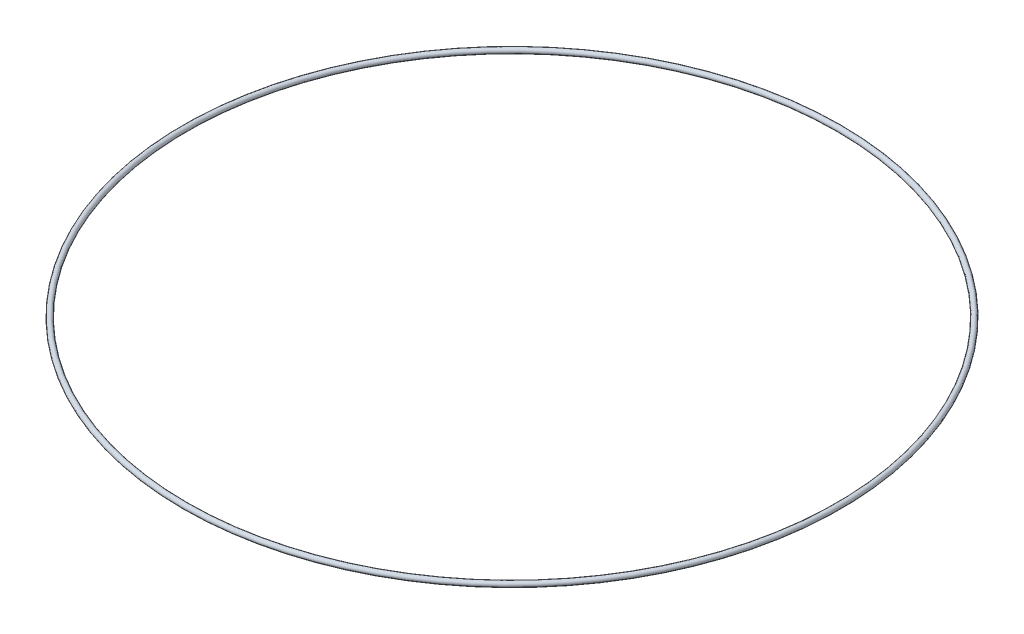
ISO-10303-21;
HEADER;
FILE_DESCRIPTION(('STEP AP214'),'2;1');
FILE_NAME('part.step','',(''),(''),'','','');
FILE_SCHEMA(('AUTOMOTIVE_DESIGN { 1 0 10303 214 1 1 1 1 }'));
ENDSEC;
DATA;
#1=APPLICATION_CONTEXT('core data for automotive mechanical design processes');
#2=APPLICATION_PROTOCOL_DEFINITION('international standard','automotive_design',2000,#1);
#3=PRODUCT_CONTEXT('',#1,'mechanical');
#4=PRODUCT('Part','Part','',(#3));
#5=PRODUCT_RELATED_PRODUCT_CATEGORY('part','',(#4));
#6=PRODUCT_DEFINITION_FORMATION('','',#4);
#7=PRODUCT_DEFINITION_CONTEXT('part definition',#1,'design');
#8=PRODUCT_DEFINITION('design','',#6,#7);
#9=PRODUCT_DEFINITION_SHAPE('','',#8);
#10=(LENGTH_UNIT() NAMED_UNIT(*) SI_UNIT(.MILLI.,.METRE.));
#11=(NAMED_UNIT(*) PLANE_ANGLE_UNIT() SI_UNIT($,.RADIAN.));
#12=(NAMED_UNIT(*) SI_UNIT($,.STERADIAN.) SOLID_ANGLE_UNIT());
#13=UNCERTAINTY_MEASURE_WITH_UNIT(LENGTH_MEASURE(1.E-05),#10,'distance_accuracy_value','');
#14=(GEOMETRIC_REPRESENTATION_CONTEXT(3) GLOBAL_UNCERTAINTY_ASSIGNED_CONTEXT((#13)) GLOBAL_UNIT_ASSIGNED_CONTEXT((#10,
#11,#12)) REPRESENTATION_CONTEXT('',''));
#15=CARTESIAN_POINT('',(0.,0.,0.));
#16=DIRECTION('',(0.,0.,1.));
#17=DIRECTION('',(1.,0.,0.));
#18=AXIS2_PLACEMENT_3D('',#15,#16,#17);
#19=CARTESIAN_POINT('',(0.,0.,0.));
#20=DIRECTION('',(0.,1.,0.));
#21=DIRECTION('',(0.,0.,1.));
#22=AXIS2_PLACEMENT_3D('',#19,#20,#21);
#23=TOROIDAL_SURFACE('',#22,295.275,2.38125000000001);
#24=CARTESIAN_POINT('',(0.,0.,297.65625));
#25=VERTEX_POINT('',#24);
#26=VERTEX_LOOP('',#25);
#27=FACE_BOUND('',#26,.T.);
#28=ADVANCED_FACE('F30',(#27),#23,.T.);
#29=CLOSED_SHELL('',(#28));
#30=MANIFOLD_SOLID_BREP('B2',#29);
#31=ADVANCED_BREP_SHAPE_REPRESENTATION('',(#18,#30),#14);
#32=SHAPE_DEFINITION_REPRESENTATION(#9,#31);
ENDSEC;
END-ISO-10303-21;
